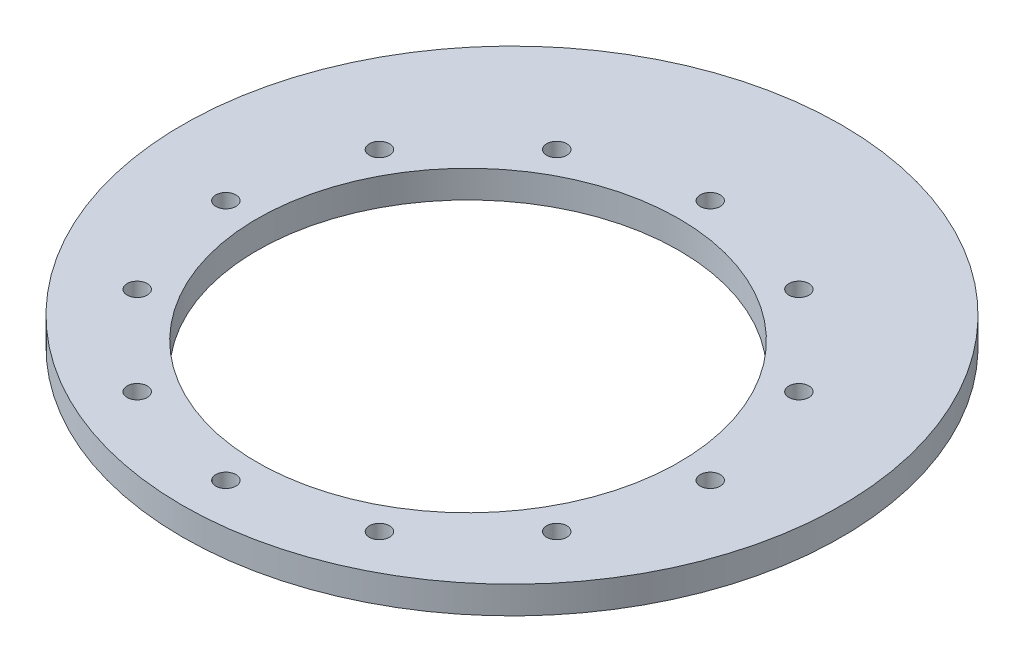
ISO-10303-21;
HEADER;
FILE_DESCRIPTION(('STEP AP214'),'2;1');
FILE_NAME('part.step','',(''),(''),'','','');
FILE_SCHEMA(('AUTOMOTIVE_DESIGN { 1 0 10303 214 1 1 1 1 }'));
ENDSEC;
DATA;
#1=APPLICATION_CONTEXT('core data for automotive mechanical design processes');
#2=APPLICATION_PROTOCOL_DEFINITION('international standard','automotive_design',2000,#1);
#3=PRODUCT_CONTEXT('',#1,'mechanical');
#4=PRODUCT('Part','Part','',(#3));
#5=PRODUCT_RELATED_PRODUCT_CATEGORY('part','',(#4));
#6=PRODUCT_DEFINITION_FORMATION('','',#4);
#7=PRODUCT_DEFINITION_CONTEXT('part definition',#1,'design');
#8=PRODUCT_DEFINITION('design','',#6,#7);
#9=PRODUCT_DEFINITION_SHAPE('','',#8);
#10=(LENGTH_UNIT() NAMED_UNIT(*) SI_UNIT(.MILLI.,.METRE.));
#11=(NAMED_UNIT(*) PLANE_ANGLE_UNIT() SI_UNIT($,.RADIAN.));
#12=(NAMED_UNIT(*) SI_UNIT($,.STERADIAN.) SOLID_ANGLE_UNIT());
#13=UNCERTAINTY_MEASURE_WITH_UNIT(LENGTH_MEASURE(1.E-05),#10,'distance_accuracy_value','');
#14=(GEOMETRIC_REPRESENTATION_CONTEXT(3) GLOBAL_UNCERTAINTY_ASSIGNED_CONTEXT((#13)) GLOBAL_UNIT_ASSIGNED_CONTEXT((#10,
#11,#12)) REPRESENTATION_CONTEXT('',''));
#15=CARTESIAN_POINT('',(0.,0.,0.));
#16=DIRECTION('',(0.,0.,1.));
#17=DIRECTION('',(1.,0.,0.));
#18=AXIS2_PLACEMENT_3D('',#15,#16,#17);
#19=CARTESIAN_POINT('',(0.,-9.525,0.));
#20=DIRECTION('',(0.,1.,0.));
#21=DIRECTION('',(0.,0.,1.));
#22=AXIS2_PLACEMENT_3D('',#19,#20,#21);
#23=CYLINDRICAL_SURFACE('',#22,114.3);
#24=CARTESIAN_POINT('',(0.,-9.525,0.));
#25=DIRECTION('',(0.,1.,0.));
#26=DIRECTION('',(0.,0.,1.));
#27=AXIS2_PLACEMENT_3D('',#24,#25,#26);
#28=CIRCLE('',#27,114.3);
#29=CARTESIAN_POINT('',(0.,-9.525,114.3));
#30=VERTEX_POINT('',#29);
#31=EDGE_CURVE('E10',#30,#30,#28,.T.);
#32=CARTESIAN_POINT('',(0.,0.,0.));
#33=DIRECTION('',(0.,1.,0.));
#34=DIRECTION('',(0.,0.,1.));
#35=AXIS2_PLACEMENT_3D('',#32,#33,#34);
#36=CIRCLE('',#35,114.3);
#37=CARTESIAN_POINT('',(0.,0.,114.3));
#38=VERTEX_POINT('',#37);
#39=EDGE_CURVE('E34',#38,#38,#36,.T.);
#40=CARTESIAN_POINT('',(0.,-9.525,114.3));
#41=CARTESIAN_POINT('',(0.,-9.42578125,114.3));
#42=CARTESIAN_POINT('',(0.,-9.3265625,114.3));
#43=CARTESIAN_POINT('',(0.,-9.128125,114.3));
#44=CARTESIAN_POINT('',(0.,-9.02890625,114.3));
#45=CARTESIAN_POINT('',(0.,-8.83046875,114.3));
#46=CARTESIAN_POINT('',(0.,-8.73125,114.3));
#47=CARTESIAN_POINT('',(0.,-8.5328125,114.3));
#48=CARTESIAN_POINT('',(0.,-8.43359375,114.3));
#49=CARTESIAN_POINT('',(0.,-8.23515625,114.3));
#50=CARTESIAN_POINT('',(0.,-8.1359375,114.3));
#51=CARTESIAN_POINT('',(0.,-7.9375,114.3));
#52=CARTESIAN_POINT('',(0.,-7.83828125,114.3));
#53=CARTESIAN_POINT('',(0.,-7.63984375,114.3));
#54=CARTESIAN_POINT('',(0.,-7.540625,114.3));
#55=CARTESIAN_POINT('',(0.,-7.3421875,114.3));
#56=CARTESIAN_POINT('',(0.,-7.24296875,114.3));
#57=CARTESIAN_POINT('',(0.,-7.04453125,114.3));
#58=CARTESIAN_POINT('',(0.,-6.9453125,114.3));
#59=CARTESIAN_POINT('',(0.,-6.746875,114.3));
#60=CARTESIAN_POINT('',(0.,-6.64765625,114.3));
#61=CARTESIAN_POINT('',(0.,-6.44921875,114.3));
#62=CARTESIAN_POINT('',(0.,-6.35,114.3));
#63=CARTESIAN_POINT('',(0.,-6.1515625,114.3));
#64=CARTESIAN_POINT('',(0.,-6.05234375,114.3));
#65=CARTESIAN_POINT('',(0.,-5.85390625,114.3));
#66=CARTESIAN_POINT('',(0.,-5.7546875,114.3));
#67=CARTESIAN_POINT('',(0.,-5.55625,114.3));
#68=CARTESIAN_POINT('',(0.,-5.45703125,114.3));
#69=CARTESIAN_POINT('',(0.,-5.25859375,114.3));
#70=CARTESIAN_POINT('',(0.,-5.159375,114.3));
#71=CARTESIAN_POINT('',(0.,-4.9609375,114.3));
#72=CARTESIAN_POINT('',(0.,-4.86171875,114.3));
#73=CARTESIAN_POINT('',(0.,-4.66328125,114.3));
#74=CARTESIAN_POINT('',(0.,-4.5640625,114.3));
#75=CARTESIAN_POINT('',(0.,-4.365625,114.3));
#76=CARTESIAN_POINT('',(0.,-4.26640625,114.3));
#77=CARTESIAN_POINT('',(0.,-4.06796875,114.3));
#78=CARTESIAN_POINT('',(0.,-3.96875,114.3));
#79=CARTESIAN_POINT('',(0.,-3.7703125,114.3));
#80=CARTESIAN_POINT('',(0.,-3.67109375,114.3));
#81=CARTESIAN_POINT('',(0.,-3.47265625,114.3));
#82=CARTESIAN_POINT('',(0.,-3.3734375,114.3));
#83=CARTESIAN_POINT('',(0.,-3.175,114.3));
#84=CARTESIAN_POINT('',(0.,-3.07578125,114.3));
#85=CARTESIAN_POINT('',(0.,-2.87734375,114.3));
#86=CARTESIAN_POINT('',(0.,-2.778125,114.3));
#87=CARTESIAN_POINT('',(0.,-2.5796875,114.3));
#88=CARTESIAN_POINT('',(0.,-2.48046875,114.3));
#89=CARTESIAN_POINT('',(0.,-2.28203125,114.3));
#90=CARTESIAN_POINT('',(0.,-2.1828125,114.3));
#91=CARTESIAN_POINT('',(0.,-1.984375,114.3));
#92=CARTESIAN_POINT('',(0.,-1.88515625,114.3));
#93=CARTESIAN_POINT('',(0.,-1.68671875,114.3));
#94=CARTESIAN_POINT('',(0.,-1.5875,114.3));
#95=CARTESIAN_POINT('',(0.,-1.3890625,114.3));
#96=CARTESIAN_POINT('',(0.,-1.28984375,114.3));
#97=CARTESIAN_POINT('',(0.,-1.09140625,114.3));
#98=CARTESIAN_POINT('',(0.,-0.992187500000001,114.3));
#99=CARTESIAN_POINT('',(0.,-0.793750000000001,114.3));
#100=CARTESIAN_POINT('',(0.,-0.69453125,114.3));
#101=CARTESIAN_POINT('',(0.,-0.49609375,114.3));
#102=CARTESIAN_POINT('',(0.,-0.396875,114.3));
#103=CARTESIAN_POINT('',(0.,-0.1984375,114.3));
#104=CARTESIAN_POINT('',(0.,-0.0992187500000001,114.3));
#105=CARTESIAN_POINT('',(0.,0.,114.3));
#106=B_SPLINE_CURVE_WITH_KNOTS('',3,(#40,#41,#42,#43,#44,#45,#46,#47,#48,#49,#50,#51,#52,#53,
#54,#55,#56,#57,#58,#59,#60,#61,#62,#63,#64,#65,#66,#67,#68,#69,#70,#71,#72,#73,#74,#75,#76,#77,
#78,#79,#80,#81,#82,#83,#84,#85,#86,#87,#88,#89,#90,#91,#92,#93,#94,#95,#96,#97,#98,#99,#100,
#101,#102,#103,#104,#105),.UNSPECIFIED.,.F.,.F.,(4,2,2,2,2,2,2,2,2,2,2,2,2,2,2,2,2,2,2,2,2,2,2,
2,2,2,2,2,2,2,2,2,4),(0.,0.29765625,0.5953125,0.892968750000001,1.190625,1.48828125,1.7859375,
2.08359375,2.38125,2.67890625,2.9765625,3.27421875,3.571875,3.86953125,4.1671875,4.46484375,
4.7625,5.06015625,5.3578125,5.65546875,5.953125,6.25078125,6.5484375,6.84609375,7.14375,
7.44140625,7.7390625,8.03671875,8.334375,8.63203125,8.9296875,9.22734375,9.525),.UNSPECIFIED.);
#107=EDGE_CURVE('BSEAM31',#30,#38,#106,.T.);
#108=ORIENTED_EDGE('',*,*,#31,.T.);
#109=ORIENTED_EDGE('',*,*,#39,.F.);
#110=ORIENTED_EDGE('',*,*,#107,.T.);
#111=ORIENTED_EDGE('',*,*,#107,.F.);
#112=EDGE_LOOP('',(#108,#110,#109,#111));
#113=FACE_BOUND('',#112,.T.);
#114=ADVANCED_FACE('F31',(#113),#23,.T.);
#115=CARTESIAN_POINT('',(0.,-9.525,0.));
#116=DIRECTION('',(0.,1.,0.));
#117=DIRECTION('',(0.,0.,1.));
#118=AXIS2_PLACEMENT_3D('',#115,#116,#117);
#119=PLANE('',#118);
#120=CARTESIAN_POINT('',(0.,-9.525,15.24));
#121=DIRECTION('',(0.,-1.,0.));
#122=DIRECTION('',(0.,0.,-1.));
#123=AXIS2_PLACEMENT_3D('',#120,#121,#122);
#124=CIRCLE('',#123,73.175);
#125=CARTESIAN_POINT('',(0.,-9.525,-57.935));
#126=VERTEX_POINT('',#125);
#127=EDGE_CURVE('E115',#126,#126,#124,.T.);
#128=ORIENTED_EDGE('',*,*,#127,.F.);
#129=EDGE_LOOP('',(#128));
#130=FACE_BOUND('',#129,.T.);
#131=CARTESIAN_POINT('',(41.9999999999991,-9.525,87.9861339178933));
#132=DIRECTION('',(0.,-1.,0.));
#133=DIRECTION('',(-0.499999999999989,0.,-0.866025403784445));
#134=AXIS2_PLACEMENT_3D('',#131,#132,#133);
#135=CIRCLE('',#134,3.49049999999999);
#136=CARTESIAN_POINT('',(40.2547499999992,-9.525,84.9632722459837));
#137=VERTEX_POINT('',#136);
#138=EDGE_CURVE('E109',#137,#137,#135,.T.);
#139=ORIENTED_EDGE('',*,*,#138,.F.);
#140=EDGE_LOOP('',(#139));
#141=FACE_BOUND('',#140,.T.);
#142=CARTESIAN_POINT('',(72.7461339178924,-9.525,57.2400000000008));
#143=DIRECTION('',(0.,-1.,0.));
#144=DIRECTION('',(-0.866025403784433,0.,-0.50000000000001));
#145=AXIS2_PLACEMENT_3D('',#142,#143,#144);
#146=CIRCLE('',#145,3.49049999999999);
#147=CARTESIAN_POINT('',(69.7232722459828,-9.525,55.4947500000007));
#148=VERTEX_POINT('',#147);
#149=EDGE_CURVE('E103',#148,#148,#146,.T.);
#150=ORIENTED_EDGE('',*,*,#149,.F.);
#151=EDGE_LOOP('',(#150));
#152=FACE_BOUND('',#151,.T.);
#153=CARTESIAN_POINT('',(84.,-9.525,15.2400000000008));
#154=DIRECTION('',(0.,-1.,0.));
#155=DIRECTION('',(-1.,0.,0.));
#156=AXIS2_PLACEMENT_3D('',#153,#154,#155);
#157=CIRCLE('',#156,3.49049999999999);
#158=CARTESIAN_POINT('',(80.5095,-9.525,15.2400000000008));
#159=VERTEX_POINT('',#158);
#160=EDGE_CURVE('E97',#159,#159,#157,.T.);
#161=ORIENTED_EDGE('',*,*,#160,.F.);
#162=EDGE_LOOP('',(#161));
#163=FACE_BOUND('',#162,.T.);
#164=CARTESIAN_POINT('',(72.7461339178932,-9.525,-26.7599999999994));
#165=DIRECTION('',(0.,-1.,0.));
#166=DIRECTION('',(-0.866025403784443,0.,0.499999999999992));
#167=AXIS2_PLACEMENT_3D('',#164,#165,#166);
#168=CIRCLE('',#167,3.49049999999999);
#169=CARTESIAN_POINT('',(69.7232722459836,-9.525,-25.0147499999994));
#170=VERTEX_POINT('',#169);
#171=EDGE_CURVE('E91',#170,#170,#168,.T.);
#172=ORIENTED_EDGE('',*,*,#171,.F.);
#173=EDGE_LOOP('',(#172));
#174=FACE_BOUND('',#173,.T.);
#175=CARTESIAN_POINT('',(42.0000000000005,-9.525,-57.5061339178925));
#176=DIRECTION('',(0.,-1.,0.));
#177=DIRECTION('',(-0.500000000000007,0.,0.866025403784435));
#178=AXIS2_PLACEMENT_3D('',#175,#176,#177);
#179=CIRCLE('',#178,3.49049999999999);
#180=CARTESIAN_POINT('',(40.2547500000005,-9.525,-54.483272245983));
#181=VERTEX_POINT('',#180);
#182=EDGE_CURVE('E85',#181,#181,#179,.T.);
#183=ORIENTED_EDGE('',*,*,#182,.F.);
#184=EDGE_LOOP('',(#183));
#185=FACE_BOUND('',#184,.T.);
#186=CARTESIAN_POINT('',(5.26986032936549E-13,-9.525,-68.76));
#187=DIRECTION('',(0.,-1.,0.));
#188=DIRECTION('',(0.,0.,1.));
#189=AXIS2_PLACEMENT_3D('',#186,#187,#188);
#190=CIRCLE('',#189,3.49049999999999);
#191=CARTESIAN_POINT('',(5.02611987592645E-13,-9.525,-65.2695));
#192=VERTEX_POINT('',#191);
#193=EDGE_CURVE('E79',#192,#192,#190,.T.);
#194=ORIENTED_EDGE('',*,*,#193,.F.);
#195=EDGE_LOOP('',(#194));
#196=FACE_BOUND('',#195,.T.);
#197=CARTESIAN_POINT('',(-41.9999999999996,-9.525,-57.506133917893));
#198=DIRECTION('',(0.,-1.,0.));
#199=DIRECTION('',(0.499999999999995,0.,0.866025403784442));
#200=AXIS2_PLACEMENT_3D('',#197,#198,#199);
#201=CIRCLE('',#200,3.49049999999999);
#202=CARTESIAN_POINT('',(-40.2547499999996,-9.525,-54.4832722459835));
#203=VERTEX_POINT('',#202);
#204=EDGE_CURVE('E73',#203,#203,#201,.T.);
#205=ORIENTED_EDGE('',*,*,#204,.F.);
#206=EDGE_LOOP('',(#205));
#207=FACE_BOUND('',#206,.T.);
#208=CARTESIAN_POINT('',(-72.7461339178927,-9.52500000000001,-26.7600000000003));
#209=DIRECTION('',(0.,-1.,0.));
#210=DIRECTION('',(0.866025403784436,0.,0.500000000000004));
#211=AXIS2_PLACEMENT_3D('',#208,#209,#210);
#212=CIRCLE('',#211,3.49049999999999);
#213=CARTESIAN_POINT('',(-69.7232722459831,-9.52500000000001,-25.0147500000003));
#214=VERTEX_POINT('',#213);
#215=EDGE_CURVE('E67',#214,#214,#212,.T.);
#216=ORIENTED_EDGE('',*,*,#215,.F.);
#217=EDGE_LOOP('',(#216));
#218=FACE_BOUND('',#217,.T.);
#219=CARTESIAN_POINT('',(-84.,-9.52500000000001,15.2399999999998));
#220=DIRECTION('',(0.,-1.,0.));
#221=DIRECTION('',(1.,0.,0.));
#222=AXIS2_PLACEMENT_3D('',#219,#220,#221);
#223=CIRCLE('',#222,3.49049999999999);
#224=CARTESIAN_POINT('',(-80.5095,-9.52500000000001,15.2399999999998));
#225=VERTEX_POINT('',#224);
#226=EDGE_CURVE('E61',#225,#225,#223,.T.);
#227=ORIENTED_EDGE('',*,*,#226,.F.);
#228=EDGE_LOOP('',(#227));
#229=FACE_BOUND('',#228,.T.);
#230=CARTESIAN_POINT('',(-72.7461339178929,-9.52500000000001,57.2399999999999));
#231=DIRECTION('',(0.,-1.,0.));
#232=DIRECTION('',(0.86602540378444,0.,-0.499999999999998));
#233=AXIS2_PLACEMENT_3D('',#230,#231,#232);
#234=CIRCLE('',#233,3.49049999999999);
#235=CARTESIAN_POINT('',(-69.7232722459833,-9.52500000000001,55.4947499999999));
#236=VERTEX_POINT('',#235);
#237=EDGE_CURVE('E55',#236,#236,#234,.T.);
#238=ORIENTED_EDGE('',*,*,#237,.F.);
#239=EDGE_LOOP('',(#238));
#240=FACE_BOUND('',#239,.T.);
#241=CARTESIAN_POINT('',(-42.,-9.525,87.9861339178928));
#242=DIRECTION('',(0.,-1.,0.));
#243=DIRECTION('',(0.500000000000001,0.,-0.866025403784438));
#244=AXIS2_PLACEMENT_3D('',#241,#242,#243);
#245=CIRCLE('',#244,3.49049999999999);
#246=CARTESIAN_POINT('',(-40.25475,-9.525,84.9632722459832));
#247=VERTEX_POINT('',#246);
#248=EDGE_CURVE('E49',#247,#247,#245,.T.);
#249=ORIENTED_EDGE('',*,*,#248,.F.);
#250=EDGE_LOOP('',(#249));
#251=FACE_BOUND('',#250,.T.);
#252=CARTESIAN_POINT('',(0.,-9.525,99.24));
#253=DIRECTION('',(0.,-1.,0.));
#254=DIRECTION('',(0.,0.,-1.));
#255=AXIS2_PLACEMENT_3D('',#252,#253,#254);
#256=CIRCLE('',#255,3.49049999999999);
#257=CARTESIAN_POINT('',(0.,-9.525,95.7495));
#258=VERTEX_POINT('',#257);
#259=EDGE_CURVE('E43',#258,#258,#256,.T.);
#260=ORIENTED_EDGE('',*,*,#259,.F.);
#261=EDGE_LOOP('',(#260));
#262=FACE_BOUND('',#261,.T.);
#263=ORIENTED_EDGE('',*,*,#31,.F.);
#264=EDGE_LOOP('',(#263));
#265=FACE_BOUND('',#264,.T.);
#266=ADVANCED_FACE('F131',(#130,#141,#152,#163,#174,#185,#196,#207,#218,#229,#240,#251,#262,
#265),#119,.F.);
#267=CARTESIAN_POINT('',(0.,0.,0.));
#268=DIRECTION('',(0.,1.,0.));
#269=DIRECTION('',(0.,0.,1.));
#270=AXIS2_PLACEMENT_3D('',#267,#268,#269);
#271=PLANE('',#270);
#272=CARTESIAN_POINT('',(0.,0.,15.24));
#273=DIRECTION('',(0.,-1.,0.));
#274=DIRECTION('',(0.,0.,-1.));
#275=AXIS2_PLACEMENT_3D('',#272,#273,#274);
#276=CIRCLE('',#275,73.175);
#277=CARTESIAN_POINT('',(0.,0.,-57.935));
#278=VERTEX_POINT('',#277);
#279=EDGE_CURVE('E112',#278,#278,#276,.T.);
#280=ORIENTED_EDGE('',*,*,#279,.T.);
#281=EDGE_LOOP('',(#280));
#282=FACE_BOUND('',#281,.T.);
#283=CARTESIAN_POINT('',(41.9999999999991,0.,87.9861339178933));
#284=DIRECTION('',(0.,-1.,0.));
#285=DIRECTION('',(-0.499999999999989,0.,-0.866025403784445));
#286=AXIS2_PLACEMENT_3D('',#283,#284,#285);
#287=CIRCLE('',#286,3.49049999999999);
#288=CARTESIAN_POINT('',(40.2547499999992,0.,84.9632722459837));
#289=VERTEX_POINT('',#288);
#290=EDGE_CURVE('E106',#289,#289,#287,.T.);
#291=ORIENTED_EDGE('',*,*,#290,.T.);
#292=EDGE_LOOP('',(#291));
#293=FACE_BOUND('',#292,.T.);
#294=CARTESIAN_POINT('',(72.7461339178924,0.,57.2400000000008));
#295=DIRECTION('',(0.,-1.,0.));
#296=DIRECTION('',(-0.866025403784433,0.,-0.50000000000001));
#297=AXIS2_PLACEMENT_3D('',#294,#295,#296);
#298=CIRCLE('',#297,3.49049999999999);
#299=CARTESIAN_POINT('',(69.7232722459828,0.,55.4947500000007));
#300=VERTEX_POINT('',#299);
#301=EDGE_CURVE('E100',#300,#300,#298,.T.);
#302=ORIENTED_EDGE('',*,*,#301,.T.);
#303=EDGE_LOOP('',(#302));
#304=FACE_BOUND('',#303,.T.);
#305=CARTESIAN_POINT('',(84.,0.,15.2400000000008));
#306=DIRECTION('',(0.,-1.,0.));
#307=DIRECTION('',(-1.,0.,0.));
#308=AXIS2_PLACEMENT_3D('',#305,#306,#307);
#309=CIRCLE('',#308,3.49049999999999);
#310=CARTESIAN_POINT('',(80.5095,0.,15.2400000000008));
#311=VERTEX_POINT('',#310);
#312=EDGE_CURVE('E94',#311,#311,#309,.T.);
#313=ORIENTED_EDGE('',*,*,#312,.T.);
#314=EDGE_LOOP('',(#313));
#315=FACE_BOUND('',#314,.T.);
#316=CARTESIAN_POINT('',(72.7461339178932,0.,-26.7599999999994));
#317=DIRECTION('',(0.,-1.,0.));
#318=DIRECTION('',(-0.866025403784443,0.,0.499999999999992));
#319=AXIS2_PLACEMENT_3D('',#316,#317,#318);
#320=CIRCLE('',#319,3.49049999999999);
#321=CARTESIAN_POINT('',(69.7232722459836,0.,-25.0147499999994));
#322=VERTEX_POINT('',#321);
#323=EDGE_CURVE('E88',#322,#322,#320,.T.);
#324=ORIENTED_EDGE('',*,*,#323,.T.);
#325=EDGE_LOOP('',(#324));
#326=FACE_BOUND('',#325,.T.);
#327=CARTESIAN_POINT('',(42.0000000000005,0.,-57.5061339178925));
#328=DIRECTION('',(0.,-1.,0.));
#329=DIRECTION('',(-0.500000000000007,0.,0.866025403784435));
#330=AXIS2_PLACEMENT_3D('',#327,#328,#329);
#331=CIRCLE('',#330,3.49049999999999);
#332=CARTESIAN_POINT('',(40.2547500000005,0.,-54.483272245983));
#333=VERTEX_POINT('',#332);
#334=EDGE_CURVE('E82',#333,#333,#331,.T.);
#335=ORIENTED_EDGE('',*,*,#334,.T.);
#336=EDGE_LOOP('',(#335));
#337=FACE_BOUND('',#336,.T.);
#338=CARTESIAN_POINT('',(5.25928545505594E-13,0.,-68.76));
#339=DIRECTION('',(0.,-1.,0.));
#340=DIRECTION('',(0.,0.,1.));
#341=AXIS2_PLACEMENT_3D('',#338,#339,#340);
#342=CIRCLE('',#341,3.49049999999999);
#343=CARTESIAN_POINT('',(5.01554500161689E-13,0.,-65.2695));
#344=VERTEX_POINT('',#343);
#345=EDGE_CURVE('E76',#344,#344,#342,.T.);
#346=ORIENTED_EDGE('',*,*,#345,.T.);
#347=EDGE_LOOP('',(#346));
#348=FACE_BOUND('',#347,.T.);
#349=CARTESIAN_POINT('',(-41.9999999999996,0.,-57.506133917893));
#350=DIRECTION('',(0.,-1.,0.));
#351=DIRECTION('',(0.499999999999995,0.,0.866025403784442));
#352=AXIS2_PLACEMENT_3D('',#349,#350,#351);
#353=CIRCLE('',#352,3.49049999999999);
#354=CARTESIAN_POINT('',(-40.2547499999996,0.,-54.4832722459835));
#355=VERTEX_POINT('',#354);
#356=EDGE_CURVE('E70',#355,#355,#353,.T.);
#357=ORIENTED_EDGE('',*,*,#356,.T.);
#358=EDGE_LOOP('',(#357));
#359=FACE_BOUND('',#358,.T.);
#360=CARTESIAN_POINT('',(-72.7461339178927,0.,-26.7600000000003));
#361=DIRECTION('',(0.,-1.,0.));
#362=DIRECTION('',(0.866025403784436,0.,0.500000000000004));
#363=AXIS2_PLACEMENT_3D('',#360,#361,#362);
#364=CIRCLE('',#363,3.49049999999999);
#365=CARTESIAN_POINT('',(-69.7232722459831,0.,-25.0147500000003));
#366=VERTEX_POINT('',#365);
#367=EDGE_CURVE('E64',#366,#366,#364,.T.);
#368=ORIENTED_EDGE('',*,*,#367,.T.);
#369=EDGE_LOOP('',(#368));
#370=FACE_BOUND('',#369,.T.);
#371=CARTESIAN_POINT('',(-84.,0.,15.2399999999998));
#372=DIRECTION('',(0.,-1.,0.));
#373=DIRECTION('',(1.,0.,0.));
#374=AXIS2_PLACEMENT_3D('',#371,#372,#373);
#375=CIRCLE('',#374,3.49049999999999);
#376=CARTESIAN_POINT('',(-80.5095,0.,15.2399999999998));
#377=VERTEX_POINT('',#376);
#378=EDGE_CURVE('E58',#377,#377,#375,.T.);
#379=ORIENTED_EDGE('',*,*,#378,.T.);
#380=EDGE_LOOP('',(#379));
#381=FACE_BOUND('',#380,.T.);
#382=CARTESIAN_POINT('',(-72.7461339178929,0.,57.2399999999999));
#383=DIRECTION('',(0.,-1.,0.));
#384=DIRECTION('',(0.86602540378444,0.,-0.499999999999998));
#385=AXIS2_PLACEMENT_3D('',#382,#383,#384);
#386=CIRCLE('',#385,3.49049999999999);
#387=CARTESIAN_POINT('',(-69.7232722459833,0.,55.4947499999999));
#388=VERTEX_POINT('',#387);
#389=EDGE_CURVE('E52',#388,#388,#386,.T.);
#390=ORIENTED_EDGE('',*,*,#389,.T.);
#391=EDGE_LOOP('',(#390));
#392=FACE_BOUND('',#391,.T.);
#393=CARTESIAN_POINT('',(-42.,0.,87.9861339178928));
#394=DIRECTION('',(0.,-1.,0.));
#395=DIRECTION('',(0.500000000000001,0.,-0.866025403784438));
#396=AXIS2_PLACEMENT_3D('',#393,#394,#395);
#397=CIRCLE('',#396,3.49049999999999);
#398=CARTESIAN_POINT('',(-40.25475,0.,84.9632722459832));
#399=VERTEX_POINT('',#398);
#400=EDGE_CURVE('E46',#399,#399,#397,.T.);
#401=ORIENTED_EDGE('',*,*,#400,.T.);
#402=EDGE_LOOP('',(#401));
#403=FACE_BOUND('',#402,.T.);
#404=CARTESIAN_POINT('',(0.,0.,99.24));
#405=DIRECTION('',(0.,-1.,0.));
#406=DIRECTION('',(0.,0.,-1.));
#407=AXIS2_PLACEMENT_3D('',#404,#405,#406);
#408=CIRCLE('',#407,3.49049999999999);
#409=CARTESIAN_POINT('',(0.,0.,95.7495));
#410=VERTEX_POINT('',#409);
#411=EDGE_CURVE('E41',#410,#410,#408,.T.);
#412=ORIENTED_EDGE('',*,*,#411,.T.);
#413=EDGE_LOOP('',(#412));
#414=FACE_BOUND('',#413,.T.);
#415=ORIENTED_EDGE('',*,*,#39,.T.);
#416=EDGE_LOOP('',(#415));
#417=FACE_BOUND('',#416,.T.);
#418=ADVANCED_FACE('F121',(#282,#293,#304,#315,#326,#337,#348,#359,#370,#381,#392,#403,#414,
#417),#271,.T.);
#419=CARTESIAN_POINT('',(0.,0.,99.24));
#420=DIRECTION('',(0.,-1.,0.));
#421=DIRECTION('',(0.,0.,-1.));
#422=AXIS2_PLACEMENT_3D('',#419,#420,#421);
#423=CYLINDRICAL_SURFACE('',#422,3.49049999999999);
#424=CARTESIAN_POINT('',(0.,0.,95.7495));
#425=CARTESIAN_POINT('',(0.,-0.0992187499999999,95.7495));
#426=CARTESIAN_POINT('',(0.,-0.1984375,95.7495));
#427=CARTESIAN_POINT('',(0.,-0.396875,95.7495));
#428=CARTESIAN_POINT('',(0.,-0.49609375,95.7495));
#429=CARTESIAN_POINT('',(0.,-0.69453125,95.7495));
#430=CARTESIAN_POINT('',(0.,-0.79375,95.7495));
#431=CARTESIAN_POINT('',(0.,-0.9921875,95.7495));
#432=CARTESIAN_POINT('',(0.,-1.09140625,95.7495));
#433=CARTESIAN_POINT('',(0.,-1.28984375,95.7495));
#434=CARTESIAN_POINT('',(0.,-1.3890625,95.7495));
#435=CARTESIAN_POINT('',(0.,-1.5875,95.7495));
#436=CARTESIAN_POINT('',(0.,-1.68671875,95.7495));
#437=CARTESIAN_POINT('',(0.,-1.88515625,95.7495));
#438=CARTESIAN_POINT('',(0.,-1.984375,95.7495));
#439=CARTESIAN_POINT('',(0.,-2.1828125,95.7495));
#440=CARTESIAN_POINT('',(0.,-2.28203125,95.7495));
#441=CARTESIAN_POINT('',(0.,-2.48046875,95.7495));
#442=CARTESIAN_POINT('',(0.,-2.5796875,95.7495));
#443=CARTESIAN_POINT('',(0.,-2.778125,95.7495));
#444=CARTESIAN_POINT('',(0.,-2.87734375,95.7495));
#445=CARTESIAN_POINT('',(0.,-3.07578125,95.7495));
#446=CARTESIAN_POINT('',(0.,-3.175,95.7495));
#447=CARTESIAN_POINT('',(0.,-3.3734375,95.7495));
#448=CARTESIAN_POINT('',(0.,-3.47265625,95.7495));
#449=CARTESIAN_POINT('',(0.,-3.67109375,95.7495));
#450=CARTESIAN_POINT('',(0.,-3.7703125,95.7495));
#451=CARTESIAN_POINT('',(0.,-3.96875,95.7495));
#452=CARTESIAN_POINT('',(0.,-4.06796875,95.7495));
#453=CARTESIAN_POINT('',(0.,-4.26640625,95.7495));
#454=CARTESIAN_POINT('',(0.,-4.365625,95.7495));
#455=CARTESIAN_POINT('',(0.,-4.5640625,95.7495));
#456=CARTESIAN_POINT('',(0.,-4.66328125,95.7495));
#457=CARTESIAN_POINT('',(0.,-4.86171875,95.7495));
#458=CARTESIAN_POINT('',(0.,-4.9609375,95.7495));
#459=CARTESIAN_POINT('',(0.,-5.159375,95.7495));
#460=CARTESIAN_POINT('',(0.,-5.25859375,95.7495));
#461=CARTESIAN_POINT('',(0.,-5.45703125,95.7495));
#462=CARTESIAN_POINT('',(0.,-5.55625,95.7495));
#463=CARTESIAN_POINT('',(0.,-5.7546875,95.7495));
#464=CARTESIAN_POINT('',(0.,-5.85390625,95.7495));
#465=CARTESIAN_POINT('',(0.,-6.05234375,95.7495));
#466=CARTESIAN_POINT('',(0.,-6.1515625,95.7495));
#467=CARTESIAN_POINT('',(0.,-6.35,95.7495));
#468=CARTESIAN_POINT('',(0.,-6.44921875,95.7495));
#469=CARTESIAN_POINT('',(0.,-6.64765625,95.7495));
#470=CARTESIAN_POINT('',(0.,-6.746875,95.7495));
#471=CARTESIAN_POINT('',(0.,-6.9453125,95.7495));
#472=CARTESIAN_POINT('',(0.,-7.04453125,95.7495));
#473=CARTESIAN_POINT('',(0.,-7.24296875,95.7495));
#474=CARTESIAN_POINT('',(0.,-7.3421875,95.7495));
#475=CARTESIAN_POINT('',(0.,-7.540625,95.7495));
#476=CARTESIAN_POINT('',(0.,-7.63984375,95.7495));
#477=CARTESIAN_POINT('',(0.,-7.83828125,95.7495));
#478=CARTESIAN_POINT('',(0.,-7.9375,95.7495));
#479=CARTESIAN_POINT('',(0.,-8.1359375,95.7495));
#480=CARTESIAN_POINT('',(0.,-8.23515625,95.7495));
#481=CARTESIAN_POINT('',(0.,-8.43359375,95.7495));
#482=CARTESIAN_POINT('',(0.,-8.5328125,95.7495));
#483=CARTESIAN_POINT('',(0.,-8.73125,95.7495));
#484=CARTESIAN_POINT('',(0.,-8.83046875,95.7495));
#485=CARTESIAN_POINT('',(0.,-9.02890625,95.7495));
#486=CARTESIAN_POINT('',(0.,-9.128125,95.7495));
#487=CARTESIAN_POINT('',(0.,-9.3265625,95.7495));
#488=CARTESIAN_POINT('',(0.,-9.42578125,95.7495));
#489=CARTESIAN_POINT('',(0.,-9.525,95.7495));
#490=B_SPLINE_CURVE_WITH_KNOTS('',3,(#424,#425,#426,#427,#428,#429,#430,#431,#432,#433,#434,
#435,#436,#437,#438,#439,#440,#441,#442,#443,#444,#445,#446,#447,#448,#449,#450,#451,#452,#453,
#454,#455,#456,#457,#458,#459,#460,#461,#462,#463,#464,#465,#466,#467,#468,#469,#470,#471,#472,
#473,#474,#475,#476,#477,#478,#479,#480,#481,#482,#483,#484,#485,#486,#487,#488,#489),
.UNSPECIFIED.,.F.,.F.,(4,2,2,2,2,2,2,2,2,2,2,2,2,2,2,2,2,2,2,2,2,2,2,2,2,2,2,2,2,2,2,2,4),(0.,
0.29765625,0.5953125,0.89296875,1.190625,1.48828125,1.7859375,2.08359375,2.38125,2.67890625,
2.9765625,3.27421875,3.571875,3.86953125,4.1671875,4.46484375,4.7625,5.06015625,5.3578125,
5.65546875,5.953125,6.25078125,6.5484375,6.84609375,7.14375,7.44140625,7.7390625,8.03671875,
8.334375,8.63203125,8.9296875,9.22734375,9.525),.UNSPECIFIED.);
#491=EDGE_CURVE('BSEAM160',#410,#258,#490,.T.);
#492=ORIENTED_EDGE('',*,*,#411,.F.);
#493=ORIENTED_EDGE('',*,*,#259,.T.);
#494=ORIENTED_EDGE('',*,*,#491,.T.);
#495=ORIENTED_EDGE('',*,*,#491,.F.);
#496=EDGE_LOOP('',(#492,#494,#493,#495));
#497=FACE_BOUND('',#496,.T.);
#498=ADVANCED_FACE('F160',(#497),#423,.F.);
#499=CARTESIAN_POINT('',(-42.,0.,87.9861339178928));
#500=DIRECTION('',(0.,-1.,0.));
#501=DIRECTION('',(0.,0.,-1.));
#502=AXIS2_PLACEMENT_3D('',#499,#500,#501);
#503=CYLINDRICAL_SURFACE('',#502,3.49049999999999);
#504=ORIENTED_EDGE('',*,*,#400,.F.);
#505=EDGE_LOOP('',(#504));
#506=FACE_BOUND('',#505,.T.);
#507=ORIENTED_EDGE('',*,*,#248,.T.);
#508=EDGE_LOOP('',(#507));
#509=FACE_BOUND('',#508,.T.);
#510=ADVANCED_FACE('F162',(#506,#509),#503,.F.);
#511=CARTESIAN_POINT('',(-72.7461339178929,0.,57.2399999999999));
#512=DIRECTION('',(0.,-1.,0.));
#513=DIRECTION('',(0.,0.,-1.));
#514=AXIS2_PLACEMENT_3D('',#511,#512,#513);
#515=CYLINDRICAL_SURFACE('',#514,3.49049999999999);
#516=ORIENTED_EDGE('',*,*,#389,.F.);
#517=EDGE_LOOP('',(#516));
#518=FACE_BOUND('',#517,.T.);
#519=ORIENTED_EDGE('',*,*,#237,.T.);
#520=EDGE_LOOP('',(#519));
#521=FACE_BOUND('',#520,.T.);
#522=ADVANCED_FACE('F169',(#518,#521),#515,.F.);
#523=CARTESIAN_POINT('',(-84.,0.,15.2399999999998));
#524=DIRECTION('',(0.,-1.,0.));
#525=DIRECTION('',(1.,0.,0.));
#526=AXIS2_PLACEMENT_3D('',#523,#524,#525);
#527=CYLINDRICAL_SURFACE('',#526,3.49049999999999);
#528=ORIENTED_EDGE('',*,*,#378,.F.);
#529=EDGE_LOOP('',(#528));
#530=FACE_BOUND('',#529,.T.);
#531=ORIENTED_EDGE('',*,*,#226,.T.);
#532=EDGE_LOOP('',(#531));
#533=FACE_BOUND('',#532,.T.);
#534=ADVANCED_FACE('F258',(#530,#533),#527,.F.);
#535=CARTESIAN_POINT('',(-72.7461339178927,0.,-26.7600000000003));
#536=DIRECTION('',(0.,-1.,0.));
#537=DIRECTION('',(1.,0.,0.));
#538=AXIS2_PLACEMENT_3D('',#535,#536,#537);
#539=CYLINDRICAL_SURFACE('',#538,3.49049999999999);
#540=ORIENTED_EDGE('',*,*,#367,.F.);
#541=EDGE_LOOP('',(#540));
#542=FACE_BOUND('',#541,.T.);
#543=ORIENTED_EDGE('',*,*,#215,.T.);
#544=EDGE_LOOP('',(#543));
#545=FACE_BOUND('',#544,.T.);
#546=ADVANCED_FACE('F250',(#542,#545),#539,.F.);
#547=CARTESIAN_POINT('',(-41.9999999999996,0.,-57.506133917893));
#548=DIRECTION('',(0.,-1.,0.));
#549=DIRECTION('',(1.,0.,0.));
#550=AXIS2_PLACEMENT_3D('',#547,#548,#549);
#551=CYLINDRICAL_SURFACE('',#550,3.49049999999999);
#552=ORIENTED_EDGE('',*,*,#356,.F.);
#553=EDGE_LOOP('',(#552));
#554=FACE_BOUND('',#553,.T.);
#555=ORIENTED_EDGE('',*,*,#204,.T.);
#556=EDGE_LOOP('',(#555));
#557=FACE_BOUND('',#556,.T.);
#558=ADVANCED_FACE('F242',(#554,#557),#551,.F.);
#559=CARTESIAN_POINT('',(5.25928545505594E-13,0.,-68.76));
#560=DIRECTION('',(0.,-1.,0.));
#561=DIRECTION('',(1.,0.,0.));
#562=AXIS2_PLACEMENT_3D('',#559,#560,#561);
#563=CYLINDRICAL_SURFACE('',#562,3.49049999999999);
#564=ORIENTED_EDGE('',*,*,#345,.F.);
#565=EDGE_LOOP('',(#564));
#566=FACE_BOUND('',#565,.T.);
#567=ORIENTED_EDGE('',*,*,#193,.T.);
#568=EDGE_LOOP('',(#567));
#569=FACE_BOUND('',#568,.T.);
#570=ADVANCED_FACE('F234',(#566,#569),#563,.F.);
#571=CARTESIAN_POINT('',(42.0000000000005,0.,-57.5061339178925));
#572=DIRECTION('',(0.,-1.,0.));
#573=DIRECTION('',(1.,0.,0.));
#574=AXIS2_PLACEMENT_3D('',#571,#572,#573);
#575=CYLINDRICAL_SURFACE('',#574,3.49049999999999);
#576=ORIENTED_EDGE('',*,*,#334,.F.);
#577=EDGE_LOOP('',(#576));
#578=FACE_BOUND('',#577,.T.);
#579=ORIENTED_EDGE('',*,*,#182,.T.);
#580=EDGE_LOOP('',(#579));
#581=FACE_BOUND('',#580,.T.);
#582=ADVANCED_FACE('F226',(#578,#581),#575,.F.);
#583=CARTESIAN_POINT('',(72.7461339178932,0.,-26.7599999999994));
#584=DIRECTION('',(0.,-1.,0.));
#585=DIRECTION('',(1.,0.,0.));
#586=AXIS2_PLACEMENT_3D('',#583,#584,#585);
#587=CYLINDRICAL_SURFACE('',#586,3.49049999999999);
#588=ORIENTED_EDGE('',*,*,#323,.F.);
#589=EDGE_LOOP('',(#588));
#590=FACE_BOUND('',#589,.T.);
#591=ORIENTED_EDGE('',*,*,#171,.T.);
#592=EDGE_LOOP('',(#591));
#593=FACE_BOUND('',#592,.T.);
#594=ADVANCED_FACE('F218',(#590,#593),#587,.F.);
#595=CARTESIAN_POINT('',(84.,0.,15.2400000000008));
#596=DIRECTION('',(0.,-1.,0.));
#597=DIRECTION('',(0.,0.,-1.));
#598=AXIS2_PLACEMENT_3D('',#595,#596,#597);
#599=CYLINDRICAL_SURFACE('',#598,3.49049999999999);
#600=ORIENTED_EDGE('',*,*,#312,.F.);
#601=EDGE_LOOP('',(#600));
#602=FACE_BOUND('',#601,.T.);
#603=ORIENTED_EDGE('',*,*,#160,.T.);
#604=EDGE_LOOP('',(#603));
#605=FACE_BOUND('',#604,.T.);
#606=ADVANCED_FACE('F210',(#602,#605),#599,.F.);
#607=CARTESIAN_POINT('',(72.7461339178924,0.,57.2400000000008));
#608=DIRECTION('',(0.,-1.,0.));
#609=DIRECTION('',(0.,0.,-1.));
#610=AXIS2_PLACEMENT_3D('',#607,#608,#609);
#611=CYLINDRICAL_SURFACE('',#610,3.49049999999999);
#612=ORIENTED_EDGE('',*,*,#301,.F.);
#613=EDGE_LOOP('',(#612));
#614=FACE_BOUND('',#613,.T.);
#615=ORIENTED_EDGE('',*,*,#149,.T.);
#616=EDGE_LOOP('',(#615));
#617=FACE_BOUND('',#616,.T.);
#618=ADVANCED_FACE('F203',(#614,#617),#611,.F.);
#619=CARTESIAN_POINT('',(41.9999999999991,0.,87.9861339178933));
#620=DIRECTION('',(0.,-1.,0.));
#621=DIRECTION('',(0.,0.,-1.));
#622=AXIS2_PLACEMENT_3D('',#619,#620,#621);
#623=CYLINDRICAL_SURFACE('',#622,3.49049999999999);
#624=ORIENTED_EDGE('',*,*,#290,.F.);
#625=EDGE_LOOP('',(#624));
#626=FACE_BOUND('',#625,.T.);
#627=ORIENTED_EDGE('',*,*,#138,.T.);
#628=EDGE_LOOP('',(#627));
#629=FACE_BOUND('',#628,.T.);
#630=ADVANCED_FACE('F127',(#626,#629),#623,.F.);
#631=CARTESIAN_POINT('',(0.,0.,15.24));
#632=DIRECTION('',(0.,-1.,0.));
#633=DIRECTION('',(0.,0.,-1.));
#634=AXIS2_PLACEMENT_3D('',#631,#632,#633);
#635=CYLINDRICAL_SURFACE('',#634,73.175);
#636=ORIENTED_EDGE('',*,*,#279,.F.);
#637=EDGE_LOOP('',(#636));
#638=FACE_BOUND('',#637,.T.);
#639=ORIENTED_EDGE('',*,*,#127,.T.);
#640=EDGE_LOOP('',(#639));
#641=FACE_BOUND('',#640,.T.);
#642=ADVANCED_FACE('F124',(#638,#641),#635,.F.);
#643=CLOSED_SHELL('',(#114,#266,#418,#498,#510,#522,#534,#546,#558,#570,#582,#594,#606,#618,
#630,#642));
#644=MANIFOLD_SOLID_BREP('B2',#643);
#645=ADVANCED_BREP_SHAPE_REPRESENTATION('',(#18,#644),#14);
#646=SHAPE_DEFINITION_REPRESENTATION(#9,#645);
ENDSEC;
END-ISO-10303-21;
